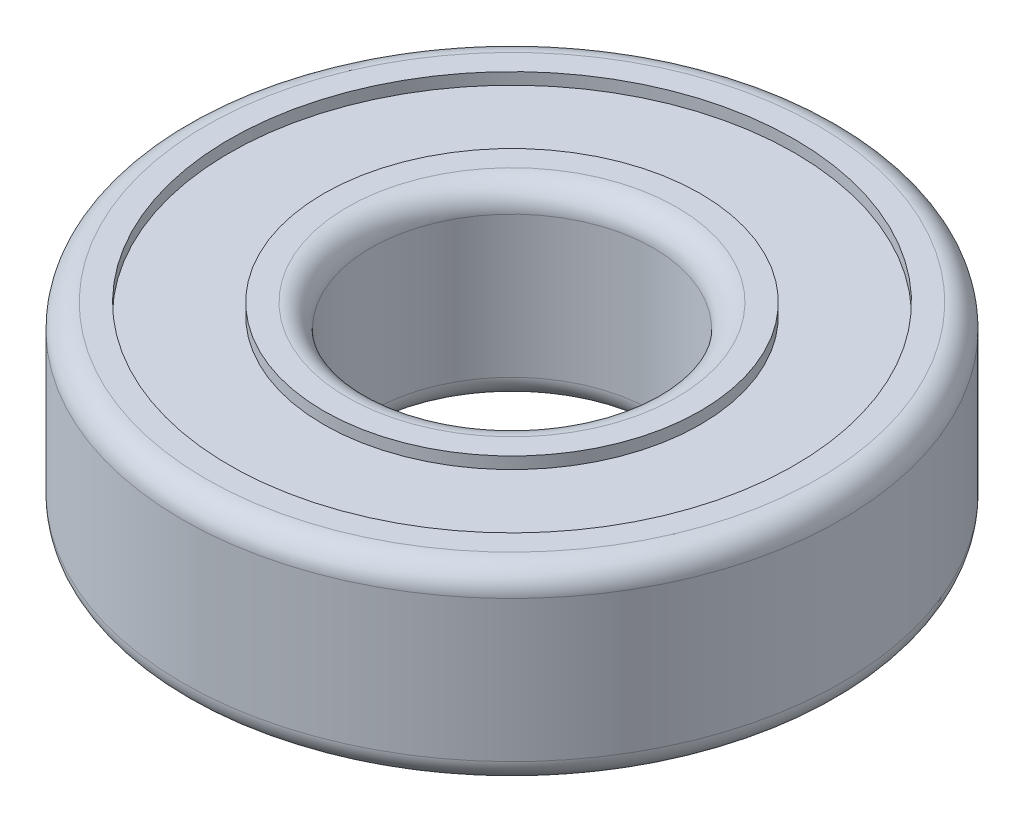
from build123d import *


with BuildPart() as part:
    # Sketch 1 → Revolve 1 (revolve)
    with BuildSketch(Plane.XY, mode=Mode.PRIVATE) as revolve_1_sk:
        with BuildLine():
            Line((-6, -3), (-6, 3))
            ThreePointArc((-6, 3), (-6.292893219, 3.707106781), (-7, 4))
            Line((-7, 4), (-8, 4))
            Line((-8, 4), (-8, 3.5))
            Line((-8, 3.5), (-12, 3.5))
            Line((-12, 3.5), (-12, 4))
            Line((-12, 4), (-13, 4))
            ThreePointArc((-13, 4), (-13.707106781, 3.707106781), (-14, 3))
            Line((-14, 3), (-14, -3))
            ThreePointArc((-14, -3), (-13.707106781, -3.707106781), (-13, -4))
            Line((-13, -4), (-12, -4))
            Line((-12, -4), (-12, -3.5))
            Line((-12, -3.5), (-8, -3.5))
            Line((-8, -3.5), (-8, -4))
            Line((-8, -4), (-7, -4))
            ThreePointArc((-7, -4), (-6.292893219, -3.707106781), (-6, -3))
        make_face()
    revolve(revolve_1_sk.sketch.rotate(Axis((0, 0, 0), (0, 1, 0)), 270), axis=Axis((0, 0, 0), (0, 1, 0)))


solid = part.part
